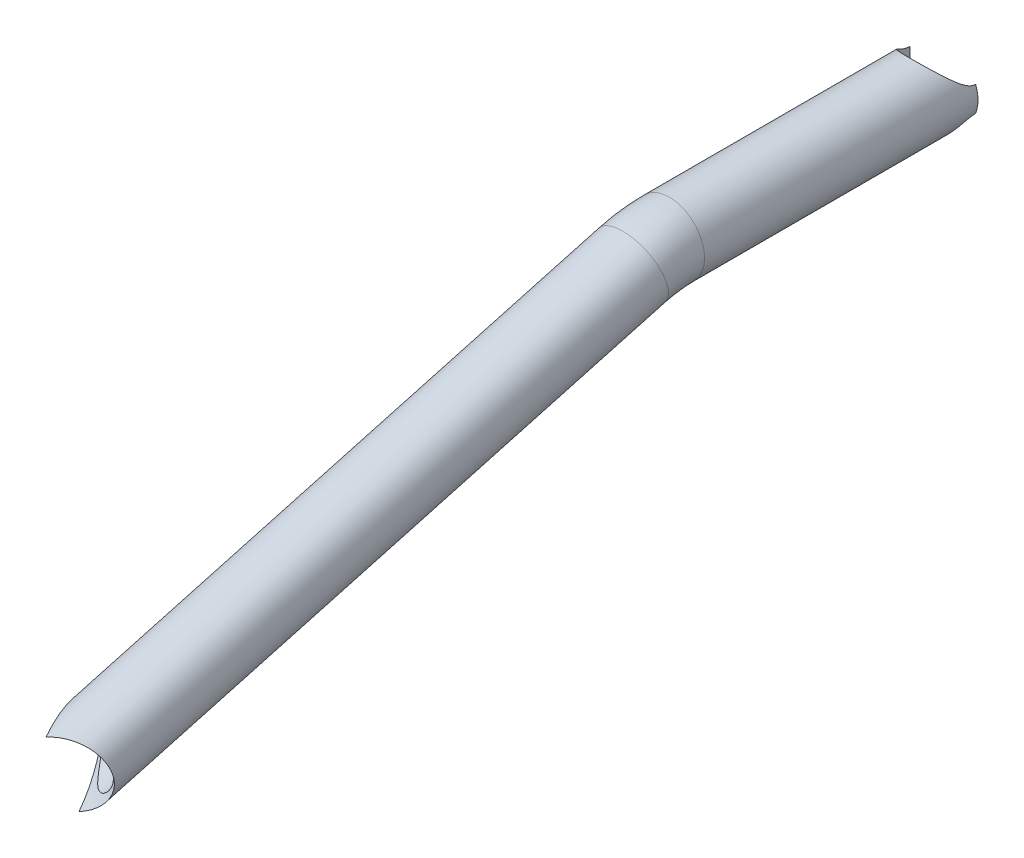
ISO-10303-21;
HEADER;
FILE_DESCRIPTION(('STEP AP214'),'2;1');
FILE_NAME('part.step','',(''),(''),'','','');
FILE_SCHEMA(('AUTOMOTIVE_DESIGN { 1 0 10303 214 1 1 1 1 }'));
ENDSEC;
DATA;
#1=APPLICATION_CONTEXT('core data for automotive mechanical design processes');
#2=APPLICATION_PROTOCOL_DEFINITION('international standard','automotive_design',2000,#1);
#3=PRODUCT_CONTEXT('',#1,'mechanical');
#4=PRODUCT('Part','Part','',(#3));
#5=PRODUCT_RELATED_PRODUCT_CATEGORY('part','',(#4));
#6=PRODUCT_DEFINITION_FORMATION('','',#4);
#7=PRODUCT_DEFINITION_CONTEXT('part definition',#1,'design');
#8=PRODUCT_DEFINITION('design','',#6,#7);
#9=PRODUCT_DEFINITION_SHAPE('','',#8);
#10=(LENGTH_UNIT() NAMED_UNIT(*) SI_UNIT(.MILLI.,.METRE.));
#11=(NAMED_UNIT(*) PLANE_ANGLE_UNIT() SI_UNIT($,.RADIAN.));
#12=(NAMED_UNIT(*) SI_UNIT($,.STERADIAN.) SOLID_ANGLE_UNIT());
#13=UNCERTAINTY_MEASURE_WITH_UNIT(LENGTH_MEASURE(1.E-05),#10,'distance_accuracy_value','');
#14=(GEOMETRIC_REPRESENTATION_CONTEXT(3) GLOBAL_UNCERTAINTY_ASSIGNED_CONTEXT((#13)) GLOBAL_UNIT_ASSIGNED_CONTEXT((#10,
#11,#12)) REPRESENTATION_CONTEXT('',''));
#15=CARTESIAN_POINT('',(0.,0.,0.));
#16=DIRECTION('',(0.,0.,1.));
#17=DIRECTION('',(1.,0.,0.));
#18=AXIS2_PLACEMENT_3D('',#15,#16,#17);
#19=CARTESIAN_POINT('',(109.471848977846,163.773719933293,0.));
#20=DIRECTION('',(0.,0.,1.));
#21=DIRECTION('',(1.,0.,0.));
#22=AXIS2_PLACEMENT_3D('',#19,#20,#21);
#23=PLANE('',#22);
#24=CARTESIAN_POINT('',(109.471848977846,163.773719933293,0.));
#25=DIRECTION('',(0.,0.,1.));
#26=DIRECTION('',(1.,0.,0.));
#27=AXIS2_PLACEMENT_3D('',#24,#25,#26);
#28=CIRCLE('',#27,15.);
#29=CARTESIAN_POINT('',(123.471848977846,158.388555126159,0.));
#30=VERTEX_POINT('',#29);
#31=CARTESIAN_POINT('',(123.471848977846,169.158884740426,0.));
#32=VERTEX_POINT('',#31);
#33=EDGE_CURVE('E105',#30,#32,#28,.T.);
#34=ORIENTED_EDGE('',*,*,#33,.F.);
#35=DIRECTION('',(0.,1.,0.));
#36=VECTOR('',#35,1.);
#37=CARTESIAN_POINT('',(123.471848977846,80.534273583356,0.));
#38=LINE('',#37,#36);
#39=EDGE_CURVE('E11',#30,#32,#38,.T.);
#40=ORIENTED_EDGE('',*,*,#39,.T.);
#41=EDGE_LOOP('',(#34,#40));
#42=FACE_BOUND('',#41,.T.);
#43=ADVANCED_FACE('F33',(#42),#23,.F.);
#44=CARTESIAN_POINT('',(109.471848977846,161.636625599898,132.498686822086));
#45=DIRECTION('',(0.,-0.264514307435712,0.964381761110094));
#46=DIRECTION('',(0.,-0.964381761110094,-0.264514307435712));
#47=AXIS2_PLACEMENT_3D('',#44,#45,#46);
#48=CYLINDRICAL_SURFACE('',#47,15.);
#49=CARTESIAN_POINT('',(109.471848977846,95.0000000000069,375.446400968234));
#50=DIRECTION('',(0.433930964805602,-0.147582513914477,0.888776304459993));
#51=DIRECTION('',(-0.876354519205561,-0.298053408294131,0.378374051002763));
#52=AXIS2_PLACEMENT_3D('',#49,#50,#51);
#53=ELLIPSE('',#52,16.7381320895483,15.);
#54=CARTESIAN_POINT('',(112.607770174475,80.8539297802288,371.56636287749));
#55=VERTEX_POINT('',#54);
#56=CARTESIAN_POINT('',(106.335927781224,109.146070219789,379.32643905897));
#57=VERTEX_POINT('',#56);
#58=EDGE_CURVE('E47',#55,#57,#53,.T.);
#59=ORIENTED_EDGE('',*,*,#58,.F.);
#60=CARTESIAN_POINT('',(109.471848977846,95.0000000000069,375.446400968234));
#61=DIRECTION('',(-0.876354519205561,-0.298053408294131,0.378374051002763));
#62=DIRECTION('',(0.433930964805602,-0.147582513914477,0.888776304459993));
#63=AXIS2_PLACEMENT_3D('',#60,#61,#62);
#64=ELLIPSE('',#63,33.8038510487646,15.);
#65=EDGE_CURVE('E66',#57,#55,#64,.T.);
#66=ORIENTED_EDGE('',*,*,#65,.F.);
#67=EDGE_LOOP('',(#59,#66));
#68=FACE_BOUND('',#67,.T.);
#69=CARTESIAN_POINT('',(109.471848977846,161.636625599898,132.498686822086));
#70=DIRECTION('',(0.,-0.264514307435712,0.964381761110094));
#71=DIRECTION('',(1.,0.,0.));
#72=AXIS2_PLACEMENT_3D('',#69,#70,#71);
#73=CIRCLE('',#72,15.);
#74=CARTESIAN_POINT('',(109.471848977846,176.10235201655,136.466401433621));
#75=VERTEX_POINT('',#74);
#76=EDGE_CURVE('E156',#75,#75,#73,.T.);
#77=ORIENTED_EDGE('',*,*,#76,.T.);
#78=EDGE_LOOP('',(#77));
#79=FACE_BOUND('',#78,.T.);
#80=ADVANCED_FACE('F35',(#68,#79),#48,.T.);
#81=CARTESIAN_POINT('',(109.471848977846,161.636625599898,132.498686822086));
#82=DIRECTION('',(0.,-0.264514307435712,0.964381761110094));
#83=DIRECTION('',(0.,-0.964381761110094,-0.264514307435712));
#84=AXIS2_PLACEMENT_3D('',#81,#82,#83);
#85=CYLINDRICAL_SURFACE('',#84,13.);
#86=CARTESIAN_POINT('',(109.471848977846,85.6589249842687,360.355959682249));
#87=CARTESIAN_POINT('',(109.673099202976,85.596906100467,360.582080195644));
#88=CARTESIAN_POINT('',(109.877765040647,85.5401497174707,360.806613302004));
#89=CARTESIAN_POINT('',(110.295252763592,85.438777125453,361.250902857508));
#90=CARTESIAN_POINT('',(110.508075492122,85.3941621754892,361.47065880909));
#91=CARTESIAN_POINT('',(110.943080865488,85.319268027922,361.903061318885));
#92=CARTESIAN_POINT('',(111.165257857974,85.2889803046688,362.115712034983));
#93=CARTESIAN_POINT('',(111.620317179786,85.2455409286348,362.531121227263));
#94=CARTESIAN_POINT('',(111.853195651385,85.2323831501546,362.733883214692));
#95=CARTESIAN_POINT('',(112.267022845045,85.2274459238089,363.073799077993));
#96=CARTESIAN_POINT('',(112.445341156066,85.2309176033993,363.214077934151));
#97=CARTESIAN_POINT('',(112.808023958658,85.2505216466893,363.485607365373));
#98=CARTESIAN_POINT('',(112.992386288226,85.266649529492,363.616861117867));
#99=CARTESIAN_POINT('',(113.366199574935,85.3130120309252,363.86835480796));
#100=CARTESIAN_POINT('',(113.555637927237,85.3432142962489,363.988619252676));
#101=CARTESIAN_POINT('',(113.938806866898,85.4189670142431,364.21690468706));
#102=CARTESIAN_POINT('',(114.132537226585,85.4645166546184,364.324926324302));
#103=CARTESIAN_POINT('',(114.523864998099,85.5721141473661,364.528345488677));
#104=CARTESIAN_POINT('',(114.721479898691,85.634274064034,364.623650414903));
#105=CARTESIAN_POINT('',(115.117028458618,85.7750868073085,364.800389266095));
#106=CARTESIAN_POINT('',(115.314962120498,85.8537397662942,364.881823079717));
#107=CARTESIAN_POINT('',(115.709208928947,86.0271968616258,365.031452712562));
#108=CARTESIAN_POINT('',(115.905518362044,86.1220308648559,365.099623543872));
#109=CARTESIAN_POINT('',(116.294080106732,86.3267642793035,365.22377056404));
#110=CARTESIAN_POINT('',(116.486331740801,86.4366661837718,365.279744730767));
#111=CARTESIAN_POINT('',(116.908650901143,86.6971713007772,365.392841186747));
#112=CARTESIAN_POINT('',(117.137249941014,86.8513227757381,365.447268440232));
#113=CARTESIAN_POINT('',(117.583529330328,87.1781548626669,365.543687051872));
#114=CARTESIAN_POINT('',(117.8012067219,87.3508404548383,365.585675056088));
#115=CARTESIAN_POINT('',(118.224574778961,87.7128542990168,365.660621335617));
#116=CARTESIAN_POINT('',(118.43024189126,87.9022135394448,365.693562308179));
#117=CARTESIAN_POINT('',(118.828191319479,88.295359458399,365.753249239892));
#118=CARTESIAN_POINT('',(119.02047313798,88.4991466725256,365.779994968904));
#119=CARTESIAN_POINT('',(119.447594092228,88.9837163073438,365.837385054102));
#120=CARTESIAN_POINT('',(119.677504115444,89.2690109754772,365.866726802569));
#121=CARTESIAN_POINT('',(120.11229477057,89.8582869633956,365.923491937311));
#122=CARTESIAN_POINT('',(120.317169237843,90.1622728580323,365.950914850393));
#123=CARTESIAN_POINT('',(120.700820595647,90.7860860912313,366.007155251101));
#124=CARTESIAN_POINT('',(120.879602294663,91.1059104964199,366.035972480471));
#125=CARTESIAN_POINT('',(121.210121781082,91.7588438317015,366.097530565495));
#126=CARTESIAN_POINT('',(121.361861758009,92.0919516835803,366.130271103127));
#127=CARTESIAN_POINT('',(121.638178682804,92.7709643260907,366.201794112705));
#128=CARTESIAN_POINT('',(121.762588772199,93.1169334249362,366.24061134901));
#129=CARTESIAN_POINT('',(121.982161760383,93.8171718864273,366.32557718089));
#130=CARTESIAN_POINT('',(122.077324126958,94.1714413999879,366.371725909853));
#131=CARTESIAN_POINT('',(122.237543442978,94.8854760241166,366.472345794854));
#132=CARTESIAN_POINT('',(122.302608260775,95.2452396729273,366.526814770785));
#133=CARTESIAN_POINT('',(122.401991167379,95.9675401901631,366.644713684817));
#134=CARTESIAN_POINT('',(122.436309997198,96.33007699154,366.708143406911));
#135=CARTESIAN_POINT('',(122.473474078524,97.0497994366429,366.84327041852));
#136=CARTESIAN_POINT('',(122.476766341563,97.4069868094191,366.914835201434));
#137=CARTESIAN_POINT('',(122.45285654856,98.1184292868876,367.066923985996));
#138=CARTESIAN_POINT('',(122.425654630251,98.4726844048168,367.147447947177));
#139=CARTESIAN_POINT('',(122.340863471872,99.1754009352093,367.317134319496));
#140=CARTESIAN_POINT('',(122.283277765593,99.5238630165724,367.406295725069));
#141=CARTESIAN_POINT('',(122.138127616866,100.212276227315,367.592685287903));
#142=CARTESIAN_POINT('',(122.050564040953,100.552227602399,367.689913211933));
#143=CARTESIAN_POINT('',(121.850349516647,101.207326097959,367.887481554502));
#144=CARTESIAN_POINT('',(121.73886942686,101.522919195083,367.987532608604));
#145=CARTESIAN_POINT('',(121.489859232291,102.141706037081,368.19335366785));
#146=CARTESIAN_POINT('',(121.352329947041,102.444900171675,368.299123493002));
#147=CARTESIAN_POINT('',(121.052319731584,103.036896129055,368.515246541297));
#148=CARTESIAN_POINT('',(120.889842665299,103.325700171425,368.625599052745));
#149=CARTESIAN_POINT('',(120.541161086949,103.887252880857,368.849606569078));
#150=CARTESIAN_POINT('',(120.354956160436,104.160001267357,368.96326163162));
#151=CARTESIAN_POINT('',(119.958245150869,104.690560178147,369.193520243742));
#152=CARTESIAN_POINT('',(119.747518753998,104.948198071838,369.310141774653));
#153=CARTESIAN_POINT('',(119.304734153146,105.444359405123,369.543526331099));
#154=CARTESIAN_POINT('',(119.072675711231,105.68288263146,369.660289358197));
#155=CARTESIAN_POINT('',(118.588510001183,106.140042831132,369.892106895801));
#156=CARTESIAN_POINT('',(118.336384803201,106.358661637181,370.007159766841));
#157=CARTESIAN_POINT('',(117.813765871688,106.775044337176,370.233189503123));
#158=CARTESIAN_POINT('',(117.543272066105,106.972808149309,370.344166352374));
#159=CARTESIAN_POINT('',(116.971421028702,107.356356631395,370.564777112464));
#160=CARTESIAN_POINT('',(116.669196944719,107.541048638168,370.674066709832));
#161=CARTESIAN_POINT('',(116.047698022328,107.886653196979,370.881536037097));
#162=CARTESIAN_POINT('',(115.728419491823,108.047560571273,370.979713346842));
#163=CARTESIAN_POINT('',(115.074901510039,108.345391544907,371.160200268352));
#164=CARTESIAN_POINT('',(114.740676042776,108.482336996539,371.242524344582));
#165=CARTESIAN_POINT('',(114.059069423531,108.732634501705,371.385517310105));
#166=CARTESIAN_POINT('',(113.711695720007,108.845999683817,371.446198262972));
#167=CARTESIAN_POINT('',(113.134190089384,109.012914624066,371.52182166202));
#168=CARTESIAN_POINT('',(112.907122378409,109.07326430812,371.545369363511));
#169=CARTESIAN_POINT('',(112.449784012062,109.184901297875,371.57840963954));
#170=CARTESIAN_POINT('',(112.219514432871,109.236191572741,371.587906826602));
#171=CARTESIAN_POINT('',(111.757594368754,109.329981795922,371.590510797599));
#172=CARTESIAN_POINT('',(111.52594811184,109.372501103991,371.583654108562));
#173=CARTESIAN_POINT('',(111.062548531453,109.44938411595,371.55138111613));
#174=CARTESIAN_POINT('',(110.830795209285,109.483747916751,371.525965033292));
#175=CARTESIAN_POINT('',(110.366852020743,109.545294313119,371.454369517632));
#176=CARTESIAN_POINT('',(110.134685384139,109.572393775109,371.40796480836));
#177=CARTESIAN_POINT('',(109.675084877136,109.619715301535,371.293347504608));
#178=CARTESIAN_POINT('',(109.4476505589,109.63993801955,371.225136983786));
#179=CARTESIAN_POINT('',(108.999964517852,109.674422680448,371.067117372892));
#180=CARTESIAN_POINT('',(108.779712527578,109.688684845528,370.977309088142));
#181=CARTESIAN_POINT('',(108.348300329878,109.712176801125,370.777497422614));
#182=CARTESIAN_POINT('',(108.137141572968,109.721405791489,370.667490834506));
#183=CARTESIAN_POINT('',(107.691070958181,109.736849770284,370.409906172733));
#184=CARTESIAN_POINT('',(107.457988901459,109.742316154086,370.259123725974));
#185=CARTESIAN_POINT('',(107.006168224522,109.748619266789,369.937404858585));
#186=CARTESIAN_POINT('',(106.787433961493,109.749454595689,369.766462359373));
#187=CARTESIAN_POINT('',(106.362902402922,109.74721563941,369.407840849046));
#188=CARTESIAN_POINT('',(106.157155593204,109.744126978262,369.220102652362));
#189=CARTESIAN_POINT('',(105.758247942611,109.734460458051,368.83191542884));
#190=CARTESIAN_POINT('',(105.565086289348,109.727882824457,368.631467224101));
#191=CARTESIAN_POINT('',(105.134996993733,109.709071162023,368.160513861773));
#192=CARTESIAN_POINT('',(104.90179210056,109.695745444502,367.886665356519));
#193=CARTESIAN_POINT('',(104.450928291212,109.663796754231,367.326670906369));
#194=CARTESIAN_POINT('',(104.233276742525,109.645171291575,367.04051923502));
#195=CARTESIAN_POINT('',(103.810769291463,109.602487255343,366.458609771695));
#196=CARTESIAN_POINT('',(103.605936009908,109.57841940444,366.162836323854));
#197=CARTESIAN_POINT('',(103.207517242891,109.524637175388,365.564415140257));
#198=CARTESIAN_POINT('',(103.013929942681,109.494923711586,365.261768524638));
#199=CARTESIAN_POINT('',(102.635488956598,109.429363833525,364.649632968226));
#200=CARTESIAN_POINT('',(102.450683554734,109.393487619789,364.340117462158));
#201=CARTESIAN_POINT('',(102.089657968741,109.315318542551,363.716916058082));
#202=CARTESIAN_POINT('',(101.913438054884,109.273025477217,363.403230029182));
#203=CARTESIAN_POINT('',(101.568888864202,109.18163245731,362.772951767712));
#204=CARTESIAN_POINT('',(101.400551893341,109.132539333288,362.456362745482));
#205=CARTESIAN_POINT('',(101.070960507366,109.027029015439,361.820733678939));
#206=CARTESIAN_POINT('',(100.90970603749,108.970611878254,361.5016936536));
#207=CARTESIAN_POINT('',(100.584027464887,108.846155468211,360.841892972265));
#208=CARTESIAN_POINT('',(100.42003072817,108.777611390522,360.501016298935));
#209=CARTESIAN_POINT('',(100.09926138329,108.63091739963,359.81792302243));
#210=CARTESIAN_POINT('',(99.9424888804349,108.552767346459,359.475706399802));
#211=CARTESIAN_POINT('',(99.6359682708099,108.385970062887,358.79036443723));
#212=CARTESIAN_POINT('',(99.4862253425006,108.297315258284,358.447238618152));
#213=CARTESIAN_POINT('',(99.1939845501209,108.108598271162,357.761034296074));
#214=CARTESIAN_POINT('',(99.0514865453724,108.008536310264,357.417955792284));
#215=CARTESIAN_POINT('',(98.7744652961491,107.796234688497,356.733716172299));
#216=CARTESIAN_POINT('',(98.6399179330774,107.684035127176,356.392552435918));
#217=CARTESIAN_POINT('',(98.3787860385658,107.445903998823,355.711916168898));
#218=CARTESIAN_POINT('',(98.2522021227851,107.319971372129,355.372443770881));
#219=CARTESIAN_POINT('',(98.0078704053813,107.053015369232,354.696695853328));
#220=CARTESIAN_POINT('',(97.8901132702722,106.912008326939,354.360417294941));
#221=CARTESIAN_POINT('',(97.6643349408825,106.613059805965,353.692207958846));
#222=CARTESIAN_POINT('',(97.5563113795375,106.455122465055,353.360276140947));
#223=CARTESIAN_POINT('',(97.345655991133,106.110900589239,352.68429908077));
#224=CARTESIAN_POINT('',(97.2436568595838,105.923528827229,352.340604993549));
#225=CARTESIAN_POINT('',(97.0541798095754,105.524663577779,351.663052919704));
#226=CARTESIAN_POINT('',(96.9667068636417,105.313161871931,351.32919833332));
#227=CARTESIAN_POINT('',(96.8096802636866,104.863967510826,350.677429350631));
#228=CARTESIAN_POINT('',(96.7400411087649,104.626407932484,350.359445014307));
#229=CARTESIAN_POINT('',(96.6220536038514,104.121384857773,349.744300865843));
#230=CARTESIAN_POINT('',(96.5736787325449,103.853959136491,349.447115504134));
#231=CARTESIAN_POINT('',(96.5035909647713,103.291367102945,348.886936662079));
#232=CARTESIAN_POINT('',(96.4814048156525,102.996800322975,348.623415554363));
#233=CARTESIAN_POINT('',(96.4707689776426,102.531349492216,348.257682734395));
#234=CARTESIAN_POINT('',(96.4710002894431,102.372225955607,348.140672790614));
#235=CARTESIAN_POINT('',(96.47960544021,102.046442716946,347.918052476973));
#236=CARTESIAN_POINT('',(96.4879756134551,101.879786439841,347.812436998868));
#237=CARTESIAN_POINT('',(96.5134889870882,101.537795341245,347.613136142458));
#238=CARTESIAN_POINT('',(96.5307213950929,101.362388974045,347.51958441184));
#239=CARTESIAN_POINT('',(96.5743462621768,101.005548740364,347.347225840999));
#240=CARTESIAN_POINT('',(96.6007384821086,100.824115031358,347.268418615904));
#241=CARTESIAN_POINT('',(96.6627522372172,100.45675687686,347.126860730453));
#242=CARTESIAN_POINT('',(96.6983672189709,100.270835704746,347.064098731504));
#243=CARTESIAN_POINT('',(96.7786372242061,99.8960564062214,346.955395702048));
#244=CARTESIAN_POINT('',(96.8232915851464,99.7071984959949,346.90945343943));
#245=CARTESIAN_POINT('',(96.9160769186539,99.3479839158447,346.838560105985));
#246=CARTESIAN_POINT('',(96.9633679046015,99.1777383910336,346.811926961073));
#247=CARTESIAN_POINT('',(97.0643312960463,98.8375052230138,346.772238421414));
#248=CARTESIAN_POINT('',(97.1180057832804,98.6675176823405,346.759187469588));
#249=CARTESIAN_POINT('',(97.2311340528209,98.3289340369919,346.746211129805));
#250=CARTESIAN_POINT('',(97.2905895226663,98.1603383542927,346.746289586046));
#251=CARTESIAN_POINT('',(97.4146231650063,97.8254971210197,346.758868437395));
#252=CARTESIAN_POINT('',(97.4792026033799,97.6592521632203,346.771371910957));
#253=CARTESIAN_POINT('',(97.6381492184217,97.2674581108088,346.814877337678));
#254=CARTESIAN_POINT('',(97.734533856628,97.0432978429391,346.851092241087));
#255=CARTESIAN_POINT('',(97.9342193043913,96.6021697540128,346.943038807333));
#256=CARTESIAN_POINT('',(98.0375230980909,96.385205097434,346.99877893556));
#257=CARTESIAN_POINT('',(98.2498469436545,95.9588363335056,347.127409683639));
#258=CARTESIAN_POINT('',(98.358876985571,95.7494465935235,347.200331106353));
#259=CARTESIAN_POINT('',(98.5813275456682,95.3389527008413,347.360959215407));
#260=CARTESIAN_POINT('',(98.6947474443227,95.1378473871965,347.448663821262));
#261=CARTESIAN_POINT('',(99.0005862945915,94.6147182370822,347.698495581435));
#262=CARTESIAN_POINT('',(99.196084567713,94.2997823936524,347.871739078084));
#263=CARTESIAN_POINT('',(99.5938200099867,93.6911844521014,348.245711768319));
#264=CARTESIAN_POINT('',(99.7960618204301,93.3975374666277,348.446460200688));
#265=CARTESIAN_POINT('',(100.205772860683,92.829463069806,348.870181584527));
#266=CARTESIAN_POINT('',(100.413252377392,92.5550782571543,349.093201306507));
#267=CARTESIAN_POINT('',(100.831893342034,92.0245126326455,349.556874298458));
#268=CARTESIAN_POINT('',(101.043056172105,91.7683388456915,349.797534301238));
#269=CARTESIAN_POINT('',(101.463537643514,91.2783298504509,350.287620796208));
#270=CARTESIAN_POINT('',(101.672793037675,91.0441248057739,350.536733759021));
#271=CARTESIAN_POINT('',(102.093648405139,90.5906471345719,351.046177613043));
#272=CARTESIAN_POINT('',(102.305248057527,90.3713724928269,351.306506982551));
#273=CARTESIAN_POINT('',(102.730867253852,89.9465173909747,351.836765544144));
#274=CARTESIAN_POINT('',(102.944889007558,89.7409508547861,352.106704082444));
#275=CARTESIAN_POINT('',(103.375156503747,89.3429488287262,352.654366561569));
#276=CARTESIAN_POINT('',(103.591402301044,89.1505136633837,352.932090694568));
#277=CARTESIAN_POINT('',(104.026327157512,88.7781207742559,353.494058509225));
#278=CARTESIAN_POINT('',(104.245006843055,88.5981663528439,353.778303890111));
#279=CARTESIAN_POINT('',(104.68504690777,88.2503646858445,354.352071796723));
#280=CARTESIAN_POINT('',(104.9064073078,88.0825175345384,354.64159436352));
#281=CARTESIAN_POINT('',(105.352130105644,87.7587949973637,355.224660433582));
#282=CARTESIAN_POINT('',(105.576490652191,87.602912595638,355.518201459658));
#283=CARTESIAN_POINT('',(106.028956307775,87.3029976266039,356.108401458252));
#284=CARTESIAN_POINT('',(106.257061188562,87.1589643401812,356.405060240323));
#285=CARTESIAN_POINT('',(106.722938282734,86.8799245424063,357.006973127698));
#286=CARTESIAN_POINT('',(106.960812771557,86.7451864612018,357.312272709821));
#287=CARTESIAN_POINT('',(107.442542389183,86.488886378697,357.923707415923));
#288=CARTESIAN_POINT('',(107.686397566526,86.3673244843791,358.229842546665));
#289=CARTESIAN_POINT('',(108.181453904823,86.1384933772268,358.841160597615));
#290=CARTESIAN_POINT('',(108.432649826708,86.0312142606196,359.146344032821));
#291=CARTESIAN_POINT('',(108.944515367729,85.832519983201,359.75393365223));
#292=CARTESIAN_POINT('',(109.205183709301,85.7411026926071,360.056340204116));
#293=CARTESIAN_POINT('',(109.471848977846,85.6589249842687,360.355959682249));
#294=B_SPLINE_CURVE_WITH_KNOTS('',3,(#86,#87,#88,#89,#90,#91,#92,#93,#94,#95,#96,#97,#98,#99,
#100,#101,#102,#103,#104,#105,#106,#107,#108,#109,#110,#111,#112,#113,#114,#115,#116,#117,#118,
#119,#120,#121,#122,#123,#124,#125,#126,#127,#128,#129,#130,#131,#132,#133,#134,#135,#136,#137,
#138,#139,#140,#141,#142,#143,#144,#145,#146,#147,#148,#149,#150,#151,#152,#153,#154,#155,#156,
#157,#158,#159,#160,#161,#162,#163,#164,#165,#166,#167,#168,#169,#170,#171,#172,#173,#174,#175,
#176,#177,#178,#179,#180,#181,#182,#183,#184,#185,#186,#187,#188,#189,#190,#191,#192,#193,#194,
#195,#196,#197,#198,#199,#200,#201,#202,#203,#204,#205,#206,#207,#208,#209,#210,#211,#212,#213,
#214,#215,#216,#217,#218,#219,#220,#221,#222,#223,#224,#225,#226,#227,#228,#229,#230,#231,#232,
#233,#234,#235,#236,#237,#238,#239,#240,#241,#242,#243,#244,#245,#246,#247,#248,#249,#250,#251,
#252,#253,#254,#255,#256,#257,#258,#259,#260,#261,#262,#263,#264,#265,#266,#267,#268,#269,#270,
#271,#272,#273,#274,#275,#276,#277,#278,#279,#280,#281,#282,#283,#284,#285,#286,#287,#288,#289,
#290,#291,#292,#293),.UNSPECIFIED.,.T.,.F.,(4,2,2,2,2,2,2,2,2,2,2,2,2,2,2,2,2,2,2,2,2,2,2,2,2,2,
2,2,2,2,2,2,2,2,2,2,2,2,2,2,2,2,2,2,2,2,2,2,2,2,2,2,2,2,2,2,2,2,2,2,2,2,2,2,2,2,2,2,2,2,2,2,2,2,
2,2,2,2,2,2,2,2,2,2,2,2,2,2,2,2,2,2,2,2,2,2,2,2,2,2,2,2,2,4),(0.,0.926904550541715,
1.85390518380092,2.78035349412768,3.70647041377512,4.3866762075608,5.06664128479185,
5.74505095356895,6.42342472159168,7.10649616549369,7.78957309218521,8.47392475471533,
9.15838979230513,10.0002280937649,10.8422931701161,11.6859576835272,12.5296535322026,
13.6309256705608,14.7324684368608,15.8338079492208,16.9350582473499,18.0428559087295,
19.1506737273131,20.2582017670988,21.3657031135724,22.4572234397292,23.5487388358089,
24.6401273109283,25.7314842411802,26.7782619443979,27.8250067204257,28.8715895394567,
29.9181906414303,30.9750507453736,32.0319226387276,33.0897496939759,34.1475808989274,
35.2582802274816,36.3692209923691,37.4791432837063,38.58844594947,39.2963091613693,
40.0039399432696,40.7099916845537,41.4160350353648,42.1298432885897,42.8435836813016,
43.5572974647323,44.2711246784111,45.1027375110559,45.934601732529,46.7695223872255,
47.6043890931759,48.6834315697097,49.7629818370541,50.8443864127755,51.9256159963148,
53.0122290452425,54.0988762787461,55.1844398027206,56.2699949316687,57.423113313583,
58.5762484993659,59.7302202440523,60.8841695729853,62.034416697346,63.1847526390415,
64.333854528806,65.4826762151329,66.6953047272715,67.9083474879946,69.1154607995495,
70.3210642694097,71.5045306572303,72.0965397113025,72.688282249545,73.2861013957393,
73.8839049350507,74.4812848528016,75.078621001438,75.6140479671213,76.1496500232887,
76.685408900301,77.2213005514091,77.9601786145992,78.6993774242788,79.4399117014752,
80.180341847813,81.4058078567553,82.6321354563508,83.8610948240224,85.0905257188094,
86.2926438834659,87.4945994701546,88.6977579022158,89.900946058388,91.1044513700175,
92.3079660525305,93.5107695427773,94.7134999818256,95.9427005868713,97.1719111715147,
98.4002649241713,99.6284536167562),.UNSPECIFIED.);
#295=CARTESIAN_POINT('',(109.471848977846,85.6589249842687,360.355959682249));
#296=VERTEX_POINT('',#295);
#297=EDGE_CURVE('E70',#296,#296,#294,.T.);
#298=ORIENTED_EDGE('',*,*,#297,.T.);
#299=EDGE_LOOP('',(#298));
#300=FACE_BOUND('',#299,.T.);
#301=CARTESIAN_POINT('',(109.471848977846,161.636625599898,132.498686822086));
#302=DIRECTION('',(0.,-0.264514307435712,0.964381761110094));
#303=DIRECTION('',(1.,0.,0.));
#304=AXIS2_PLACEMENT_3D('',#301,#302,#303);
#305=CIRCLE('',#304,13.);
#306=CARTESIAN_POINT('',(109.471848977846,174.173588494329,135.93737281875));
#307=VERTEX_POINT('',#306);
#308=EDGE_CURVE('E153',#307,#307,#305,.T.);
#309=ORIENTED_EDGE('',*,*,#308,.F.);
#310=EDGE_LOOP('',(#309));
#311=FACE_BOUND('',#310,.T.);
#312=ADVANCED_FACE('F119',(#300,#311),#85,.F.);
#313=CARTESIAN_POINT('',(109.471848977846,103.773719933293,116.627828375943));
#314=DIRECTION('',(1.,0.,0.));
#315=DIRECTION('',(0.,1.,0.));
#316=AXIS2_PLACEMENT_3D('',#313,#314,#315);
#317=TOROIDAL_SURFACE('',#316,60.,15.);
#318=CARTESIAN_POINT('',(109.471848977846,163.773719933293,116.627828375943));
#319=DIRECTION('',(0.,0.,1.));
#320=DIRECTION('',(1.,0.,0.));
#321=AXIS2_PLACEMENT_3D('',#318,#319,#320);
#322=CIRCLE('',#321,15.);
#323=CARTESIAN_POINT('',(109.471848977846,178.773719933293,116.627828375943));
#324=VERTEX_POINT('',#323);
#325=EDGE_CURVE('E150',#324,#324,#322,.T.);
#326=CARTESIAN_POINT('',(109.471848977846,103.773719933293,116.627828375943));
#327=DIRECTION('',(1.,0.,0.));
#328=DIRECTION('',(0.,1.,0.));
#329=AXIS2_PLACEMENT_3D('',#326,#327,#328);
#330=CIRCLE('',#329,75.);
#331=EDGE_CURVE('',#324,#75,#330,.T.);
#332=ORIENTED_EDGE('',*,*,#325,.T.);
#333=ORIENTED_EDGE('',*,*,#76,.F.);
#334=ORIENTED_EDGE('',*,*,#331,.T.);
#335=ORIENTED_EDGE('',*,*,#331,.F.);
#336=EDGE_LOOP('',(#332,#334,#333,#335));
#337=FACE_BOUND('',#336,.T.);
#338=ADVANCED_FACE('F116',(#337),#317,.T.);
#339=CARTESIAN_POINT('',(109.471848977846,103.773719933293,116.627828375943));
#340=DIRECTION('',(1.,0.,0.));
#341=DIRECTION('',(0.,1.,0.));
#342=AXIS2_PLACEMENT_3D('',#339,#340,#341);
#343=TOROIDAL_SURFACE('',#342,60.,13.);
#344=CARTESIAN_POINT('',(109.471848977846,163.773719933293,116.627828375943));
#345=DIRECTION('',(0.,0.,1.));
#346=DIRECTION('',(1.,0.,0.));
#347=AXIS2_PLACEMENT_3D('',#344,#345,#346);
#348=CIRCLE('',#347,13.);
#349=CARTESIAN_POINT('',(109.471848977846,176.773719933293,116.627828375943));
#350=VERTEX_POINT('',#349);
#351=EDGE_CURVE('E106',#350,#350,#348,.T.);
#352=CARTESIAN_POINT('',(109.471848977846,103.773719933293,116.627828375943));
#353=DIRECTION('',(1.,0.,0.));
#354=DIRECTION('',(0.,1.,0.));
#355=AXIS2_PLACEMENT_3D('',#352,#353,#354);
#356=CIRCLE('',#355,73.);
#357=EDGE_CURVE('',#350,#307,#356,.T.);
#358=ORIENTED_EDGE('',*,*,#351,.F.);
#359=ORIENTED_EDGE('',*,*,#308,.T.);
#360=ORIENTED_EDGE('',*,*,#357,.T.);
#361=ORIENTED_EDGE('',*,*,#357,.F.);
#362=EDGE_LOOP('',(#358,#360,#359,#361));
#363=FACE_BOUND('',#362,.T.);
#364=ADVANCED_FACE('F112',(#363),#343,.F.);
#365=CARTESIAN_POINT('',(109.471848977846,163.773719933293,116.627828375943));
#366=DIRECTION('',(0.,0.,-1.));
#367=DIRECTION('',(-1.,0.,0.));
#368=AXIS2_PLACEMENT_3D('',#365,#366,#367);
#369=CYLINDRICAL_SURFACE('',#368,13.);
#370=CARTESIAN_POINT('',(96.4718489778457,163.773719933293,5.19615242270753));
#371=CARTESIAN_POINT('',(96.4718510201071,163.597434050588,5.19616099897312));
#372=CARTESIAN_POINT('',(96.4754497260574,163.421099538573,5.20518907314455));
#373=CARTESIAN_POINT('',(96.4896996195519,163.070398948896,5.24062406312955));
#374=CARTESIAN_POINT('',(96.5003564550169,162.896034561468,5.26704489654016));
#375=CARTESIAN_POINT('',(96.5283795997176,162.550274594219,5.33553731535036));
#376=CARTESIAN_POINT('',(96.5457728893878,162.378893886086,5.37767181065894));
#377=CARTESIAN_POINT('',(96.5867590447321,162.040653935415,5.47514849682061));
#378=CARTESIAN_POINT('',(96.6103557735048,161.873797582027,5.53049891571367));
#379=CARTESIAN_POINT('',(96.6773349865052,161.457341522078,5.68424561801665));
#380=CARTESIAN_POINT('',(96.7245599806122,161.211036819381,5.78986171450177));
#381=CARTESIAN_POINT('',(96.830927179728,160.729375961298,6.01855700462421));
#382=CARTESIAN_POINT('',(96.8900789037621,160.494028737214,6.14165012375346));
#383=CARTESIAN_POINT('',(97.0195230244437,160.032439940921,6.40004180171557));
#384=CARTESIAN_POINT('',(97.0898475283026,159.806227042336,6.53537503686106));
#385=CARTESIAN_POINT('',(97.2409655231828,159.362316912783,6.81400310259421));
#386=CARTESIAN_POINT('',(97.3217625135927,159.144622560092,6.95730058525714));
#387=CARTESIAN_POINT('',(97.4892117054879,158.727499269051,7.24170344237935));
#388=CARTESIAN_POINT('',(97.5753695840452,158.527701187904,7.38256055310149));
#389=CARTESIAN_POINT('',(97.7567325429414,158.134310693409,7.66710862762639));
#390=CARTESIAN_POINT('',(97.8519389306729,157.940719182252,7.81079999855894));
#391=CARTESIAN_POINT('',(98.1511968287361,157.368369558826,8.24414445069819));
#392=CARTESIAN_POINT('',(98.3688155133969,156.998213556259,8.53594381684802));
#393=CARTESIAN_POINT('',(98.8402434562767,156.28018749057,9.11640638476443));
#394=CARTESIAN_POINT('',(99.0940056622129,155.932289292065,9.40507314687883));
#395=CARTESIAN_POINT('',(99.6387899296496,155.259129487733,9.97325045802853));
#396=CARTESIAN_POINT('',(99.9297907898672,154.933855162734,10.2527661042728));
#397=CARTESIAN_POINT('',(100.469583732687,154.389393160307,10.7262585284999));
#398=CARTESIAN_POINT('',(100.709750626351,154.164569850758,10.9236196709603));
#399=CARTESIAN_POINT('',(101.211413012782,153.730050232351,11.3077393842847));
#400=CARTESIAN_POINT('',(101.472908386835,153.520353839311,11.4944980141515));
#401=CARTESIAN_POINT('',(102.016923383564,153.118283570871,11.8545495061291));
#402=CARTESIAN_POINT('',(102.299413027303,152.925885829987,12.0278608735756));
#403=CARTESIAN_POINT('',(102.885465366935,152.560391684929,12.3585058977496));
#404=CARTESIAN_POINT('',(103.189023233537,152.387290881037,12.5158431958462));
#405=CARTESIAN_POINT('',(103.752072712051,152.096264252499,12.7812433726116));
#406=CARTESIAN_POINT('',(104.007839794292,151.974302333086,12.892795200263));
#407=CARTESIAN_POINT('',(104.531446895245,151.745669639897,13.1023625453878));
#408=CARTESIAN_POINT('',(104.799284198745,151.638995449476,13.2003810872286));
#409=CARTESIAN_POINT('',(105.345922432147,151.442415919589,13.3813146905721));
#410=CARTESIAN_POINT('',(105.624719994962,151.35250547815,13.4642343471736));
#411=CARTESIAN_POINT('',(106.191890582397,151.190842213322,13.6135171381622));
#412=CARTESIAN_POINT('',(106.480263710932,151.119089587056,13.6798800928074));
#413=CARTESIAN_POINT('',(107.066761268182,150.99459465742,13.7951253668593));
#414=CARTESIAN_POINT('',(107.364940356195,150.941990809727,13.8438803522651));
#415=CARTESIAN_POINT('',(107.966740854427,150.8575688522,13.9221660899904));
#416=CARTESIAN_POINT('',(108.270362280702,150.825750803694,13.9516967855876));
#417=CARTESIAN_POINT('',(108.880255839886,150.783592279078,13.9908311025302));
#418=CARTESIAN_POINT('',(109.18652687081,150.773243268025,14.0004426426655));
#419=CARTESIAN_POINT('',(109.798987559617,150.774230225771,13.999526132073));
#420=CARTESIAN_POINT('',(110.105177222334,150.785564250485,13.9889998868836));
#421=CARTESIAN_POINT('',(110.68036810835,150.827173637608,13.9503767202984));
#422=CARTESIAN_POINT('',(110.949681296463,150.855177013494,13.9243875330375));
#423=CARTESIAN_POINT('',(111.484151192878,150.927578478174,13.8572423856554));
#424=CARTESIAN_POINT('',(111.749308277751,150.971975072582,13.8160878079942));
#425=CARTESIAN_POINT('',(112.273828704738,151.076458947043,13.7193311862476));
#426=CARTESIAN_POINT('',(112.533191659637,151.136547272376,13.6637281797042));
#427=CARTESIAN_POINT('',(113.044699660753,151.271531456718,13.5389826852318));
#428=CARTESIAN_POINT('',(113.296844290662,151.34642816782,13.4698394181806));
#429=CARTESIAN_POINT('',(113.801947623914,151.513068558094,13.3162490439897));
#430=CARTESIAN_POINT('',(114.054589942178,151.605333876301,13.2313295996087));
#431=CARTESIAN_POINT('',(114.549963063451,151.803591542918,13.0492312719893));
#432=CARTESIAN_POINT('',(114.792690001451,151.909589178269,12.9520476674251));
#433=CARTESIAN_POINT('',(115.26744174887,152.134129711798,12.746685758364));
#434=CARTESIAN_POINT('',(115.49946619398,152.252673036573,12.6385070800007));
#435=CARTESIAN_POINT('',(115.952373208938,152.501206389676,12.4123691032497));
#436=CARTESIAN_POINT('',(116.173253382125,152.631198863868,12.2944077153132));
#437=CARTESIAN_POINT('',(116.716326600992,152.972447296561,11.9858136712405));
#438=CARTESIAN_POINT('',(117.030985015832,153.190603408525,11.7894805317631));
#439=CARTESIAN_POINT('',(117.633466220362,153.647951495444,11.3807140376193));
#440=CARTESIAN_POINT('',(117.921276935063,153.88715284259,11.1682735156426));
#441=CARTESIAN_POINT('',(118.470887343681,154.384628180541,10.7303799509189));
#442=CARTESIAN_POINT('',(118.732619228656,154.642948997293,10.5048952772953));
#443=CARTESIAN_POINT('',(119.229675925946,155.1761812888,10.0448726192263));
#444=CARTESIAN_POINT('',(119.465005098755,155.451090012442,9.81033613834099));
#445=CARTESIAN_POINT('',(119.915472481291,156.023449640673,9.3296247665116));
#446=CARTESIAN_POINT('',(120.129956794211,156.321292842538,9.08330550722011));
#447=CARTESIAN_POINT('',(120.532472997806,156.932907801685,8.58861253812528));
#448=CARTESIAN_POINT('',(120.720496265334,157.246684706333,8.34023818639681));
#449=CARTESIAN_POINT('',(121.069940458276,157.890012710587,7.84699531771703));
#450=CARTESIAN_POINT('',(121.231421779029,158.219525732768,7.60212003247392));
#451=CARTESIAN_POINT('',(121.52806824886,158.896804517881,7.12228312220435));
#452=CARTESIAN_POINT('',(121.663253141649,159.244556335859,6.88731416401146));
#453=CARTESIAN_POINT('',(121.890216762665,159.914696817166,6.46784684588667));
#454=CARTESIAN_POINT('',(121.985379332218,160.234288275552,6.28079570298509));
#455=CARTESIAN_POINT('',(122.111389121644,160.728911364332,6.02091456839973));
#456=CARTESIAN_POINT('',(122.150606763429,160.896344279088,5.93772878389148));
#457=CARTESIAN_POINT('',(122.223067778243,161.236643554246,5.78047461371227));
#458=CARTESIAN_POINT('',(122.256311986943,161.409509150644,5.70640495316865));
#459=CARTESIAN_POINT('',(122.335816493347,161.875165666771,5.52570764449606));
#460=CARTESIAN_POINT('',(122.376557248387,162.17309996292,5.42907315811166));
#461=CARTESIAN_POINT('',(122.422288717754,162.629398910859,5.3186190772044));
#462=CARTESIAN_POINT('',(122.434964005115,162.782899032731,5.28756520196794));
#463=CARTESIAN_POINT('',(122.454900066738,163.09227771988,5.23842472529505));
#464=CARTESIAN_POINT('',(122.46216389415,163.24815489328,5.2203308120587));
#465=CARTESIAN_POINT('',(122.471092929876,163.562513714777,5.19805821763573));
#466=CARTESIAN_POINT('',(122.472706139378,163.721006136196,5.19400878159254));
#467=CARTESIAN_POINT('',(122.47013392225,164.037643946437,5.20044213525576));
#468=CARTESIAN_POINT('',(122.465948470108,164.19578933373,5.2109249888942));
#469=CARTESIAN_POINT('',(122.451908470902,164.5105573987,5.24579844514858));
#470=CARTESIAN_POINT('',(122.442043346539,164.667176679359,5.27021499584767));
#471=CARTESIAN_POINT('',(122.416930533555,164.97751705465,5.33159965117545));
#472=CARTESIAN_POINT('',(122.401680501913,165.131236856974,5.36857321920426));
#473=CARTESIAN_POINT('',(122.35963870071,165.490871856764,5.46889467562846));
#474=CARTESIAN_POINT('',(122.330664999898,165.695216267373,5.5369417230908));
#475=CARTESIAN_POINT('',(122.264262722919,166.096562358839,5.68867235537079));
#476=CARTESIAN_POINT('',(122.226829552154,166.293559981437,5.7723644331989));
#477=CARTESIAN_POINT('',(122.144130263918,166.681066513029,5.95172846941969));
#478=CARTESIAN_POINT('',(122.098838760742,166.871551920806,6.04743896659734));
#479=CARTESIAN_POINT('',(122.00103519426,167.246033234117,6.24755225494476));
#480=CARTESIAN_POINT('',(121.948520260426,167.430026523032,6.35195849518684));
#481=CARTESIAN_POINT('',(121.833869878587,167.801127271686,6.57241407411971));
#482=CARTESIAN_POINT('',(121.771386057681,167.987935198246,6.68878416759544));
#483=CARTESIAN_POINT('',(121.639160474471,168.355715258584,6.92640296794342));
#484=CARTESIAN_POINT('',(121.569419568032,168.536688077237,7.04765109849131));
#485=CARTESIAN_POINT('',(121.34940766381,169.072098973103,7.41656252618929));
#486=CARTESIAN_POINT('',(121.188434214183,169.418752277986,7.66922210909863));
#487=CARTESIAN_POINT('',(120.838166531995,170.094455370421,8.17942451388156));
#488=CARTESIAN_POINT('',(120.648830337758,170.423478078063,8.43697406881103));
#489=CARTESIAN_POINT('',(120.241762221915,171.064328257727,8.9507749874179));
#490=CARTESIAN_POINT('',(120.024040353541,171.376161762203,9.20702677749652));
#491=CARTESIAN_POINT('',(119.539758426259,172.008339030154,9.73531485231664));
#492=CARTESIAN_POINT('',(119.270618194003,172.327145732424,10.0068367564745));
#493=CARTESIAN_POINT('',(118.697141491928,172.942739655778,10.5378724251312));
#494=CARTESIAN_POINT('',(118.392794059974,173.239519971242,10.7973824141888));
#495=CARTESIAN_POINT('',(117.749286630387,173.807038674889,11.2982196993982));
#496=CARTESIAN_POINT('',(117.41024178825,174.077857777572,11.5396028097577));
#497=CARTESIAN_POINT('',(116.696462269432,174.590264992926,11.9993701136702));
#498=CARTESIAN_POINT('',(116.321753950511,174.831874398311,12.2177710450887));
#499=CARTESIAN_POINT('',(115.685287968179,175.196177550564,12.5486707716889));
#500=CARTESIAN_POINT('',(115.434115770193,175.329395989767,12.6700844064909));
#501=CARTESIAN_POINT('',(114.91881998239,175.581033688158,12.9000014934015));
#502=CARTESIAN_POINT('',(114.654700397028,175.699457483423,13.0085089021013));
#503=CARTESIAN_POINT('',(114.114436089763,175.919973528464,13.2109639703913));
#504=CARTESIAN_POINT('',(113.838295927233,176.022071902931,13.3049170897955));
#505=CARTESIAN_POINT('',(113.275150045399,176.208463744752,13.4767037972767));
#506=CARTESIAN_POINT('',(112.988143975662,176.292756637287,13.5545368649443));
#507=CARTESIAN_POINT('',(112.402643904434,176.442677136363,13.6931242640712));
#508=CARTESIAN_POINT('',(112.104076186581,176.508149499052,13.7537365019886));
#509=CARTESIAN_POINT('',(111.499860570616,176.618230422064,13.8557215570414));
#510=CARTESIAN_POINT('',(111.194212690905,176.662839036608,13.8970944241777));
#511=CARTESIAN_POINT('',(110.578617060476,176.730219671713,13.9596105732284));
#512=CARTESIAN_POINT('',(110.268671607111,176.753002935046,13.9807642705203));
#513=CARTESIAN_POINT('',(109.647238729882,176.776253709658,14.0023521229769));
#514=CARTESIAN_POINT('',(109.335751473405,176.776723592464,14.002788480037));
#515=CARTESIAN_POINT('',(108.750630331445,176.756603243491,13.9841070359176));
#516=CARTESIAN_POINT('',(108.476832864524,176.73847139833,13.9672718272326));
#517=CARTESIAN_POINT('',(107.932374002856,176.685141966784,13.9177842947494));
#518=CARTESIAN_POINT('',(107.661712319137,176.649945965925,13.8851334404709));
#519=CARTESIAN_POINT('',(107.12535049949,176.563081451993,13.8046188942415));
#520=CARTESIAN_POINT('',(106.859650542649,176.511412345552,13.7567546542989));
#521=CARTESIAN_POINT('',(106.334826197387,176.392416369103,13.6466476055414));
#522=CARTESIAN_POINT('',(106.075702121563,176.325088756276,13.584404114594));
#523=CARTESIAN_POINT('',(105.562798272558,176.174988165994,13.4458399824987));
#524=CARTESIAN_POINT('',(105.309099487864,176.092065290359,13.3693828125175));
#525=CARTESIAN_POINT('',(104.810805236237,175.912289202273,13.2039247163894));
#526=CARTESIAN_POINT('',(104.566213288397,175.815430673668,13.1149190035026));
#527=CARTESIAN_POINT('',(104.087029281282,175.608912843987,12.92555963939));
#528=CARTESIAN_POINT('',(103.852437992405,175.499252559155,12.8252051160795));
#529=CARTESIAN_POINT('',(103.393812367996,175.268215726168,12.6143255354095));
#530=CARTESIAN_POINT('',(103.169780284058,175.146836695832,12.5037983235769));
#531=CARTESIAN_POINT('',(102.624672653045,174.830781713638,12.2168854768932));
#532=CARTESIAN_POINT('',(102.310315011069,174.629512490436,12.0349333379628));
#533=CARTESIAN_POINT('',(101.706548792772,174.206178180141,11.6545078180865));
#534=CARTESIAN_POINT('',(101.417150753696,173.984104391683,11.4560275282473));
#535=CARTESIAN_POINT('',(100.862818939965,173.521295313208,11.0455315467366));
#536=CARTESIAN_POINT('',(100.597934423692,173.280524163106,10.8334899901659));
#537=CARTESIAN_POINT('',(100.092972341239,172.782736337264,10.3993999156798));
#538=CARTESIAN_POINT('',(99.852891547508,172.525721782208,10.1773527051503));
#539=CARTESIAN_POINT('',(99.3915949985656,171.990546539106,9.72091673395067));
#540=CARTESIAN_POINT('',(99.1709603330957,171.712029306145,9.48636025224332));
#541=CARTESIAN_POINT('',(98.7545293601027,171.140145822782,9.01323221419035));
#542=CARTESIAN_POINT('',(98.5587377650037,170.846776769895,8.77465990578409));
#543=CARTESIAN_POINT('',(98.1918182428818,170.245568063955,8.29767006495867));
#544=CARTESIAN_POINT('',(98.0206627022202,169.937745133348,8.05925266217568));
#545=CARTESIAN_POINT('',(97.7026238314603,169.306382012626,7.58723236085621));
#546=CARTESIAN_POINT('',(97.5557301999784,168.982848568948,7.35362745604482));
#547=CARTESIAN_POINT('',(97.3485506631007,168.470846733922,7.00329033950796));
#548=CARTESIAN_POINT('',(97.279535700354,168.288801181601,6.88228363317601));
#549=CARTESIAN_POINT('',(97.1488407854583,167.918835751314,6.64542915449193));
#550=CARTESIAN_POINT('',(97.0871595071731,167.730916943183,6.52958045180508));
#551=CARTESIAN_POINT('',(96.9714078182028,167.348473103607,6.30514874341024));
#552=CARTESIAN_POINT('',(96.9173366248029,167.153948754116,6.19656499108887));
#553=CARTESIAN_POINT('',(96.8172828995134,166.757637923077,5.9895896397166));
#554=CARTESIAN_POINT('',(96.7712978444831,166.555853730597,5.89119486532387));
#555=CARTESIAN_POINT('',(96.6692327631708,166.050968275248,5.66693850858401));
#556=CARTESIAN_POINT('',(96.6179646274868,165.743245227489,5.54872509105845));
#557=CARTESIAN_POINT('',(96.5572597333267,165.269917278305,5.40519502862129));
#558=CARTESIAN_POINT('',(96.5397375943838,165.110415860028,5.36301892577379));
#559=CARTESIAN_POINT('',(96.5104692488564,164.788006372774,5.29189158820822));
#560=CARTESIAN_POINT('',(96.4987187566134,164.625100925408,5.26293054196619));
#561=CARTESIAN_POINT('',(96.4840061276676,164.347256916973,5.22648946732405));
#562=CARTESIAN_POINT('',(96.4794548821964,164.232898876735,5.2151477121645));
#563=CARTESIAN_POINT('',(96.4733756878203,164.0036074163,5.1999765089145));
#564=CARTESIAN_POINT('',(96.4718476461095,163.888674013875,5.19614683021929));
#565=CARTESIAN_POINT('',(96.4718489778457,163.773719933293,5.19615242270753));
#566=B_SPLINE_CURVE_WITH_KNOTS('',3,(#370,#371,#372,#373,#374,#375,#376,#377,#378,#379,#380,
#381,#382,#383,#384,#385,#386,#387,#388,#389,#390,#391,#392,#393,#394,#395,#396,#397,#398,#399,
#400,#401,#402,#403,#404,#405,#406,#407,#408,#409,#410,#411,#412,#413,#414,#415,#416,#417,#418,
#419,#420,#421,#422,#423,#424,#425,#426,#427,#428,#429,#430,#431,#432,#433,#434,#435,#436,#437,
#438,#439,#440,#441,#442,#443,#444,#445,#446,#447,#448,#449,#450,#451,#452,#453,#454,#455,#456,
#457,#458,#459,#460,#461,#462,#463,#464,#465,#466,#467,#468,#469,#470,#471,#472,#473,#474,#475,
#476,#477,#478,#479,#480,#481,#482,#483,#484,#485,#486,#487,#488,#489,#490,#491,#492,#493,#494,
#495,#496,#497,#498,#499,#500,#501,#502,#503,#504,#505,#506,#507,#508,#509,#510,#511,#512,#513,
#514,#515,#516,#517,#518,#519,#520,#521,#522,#523,#524,#525,#526,#527,#528,#529,#530,#531,#532,
#533,#534,#535,#536,#537,#538,#539,#540,#541,#542,#543,#544,#545,#546,#547,#548,#549,#550,#551,
#552,#553,#554,#555,#556,#557,#558,#559,#560,#561,#562,#563,#564,#565),.UNSPECIFIED.,.T.,.F.,(4,
2,2,2,2,2,2,2,2,2,2,2,2,2,2,2,2,2,2,2,2,2,2,2,2,2,2,2,2,2,2,2,2,2,2,2,2,2,2,2,2,2,2,2,2,2,2,2,2,
2,2,2,2,2,2,2,2,2,2,2,2,2,2,2,2,2,2,2,2,2,2,2,2,2,2,2,2,2,2,2,2,2,2,2,2,2,2,2,2,2,2,2,2,2,2,2,2,
4),(0.,0.528686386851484,1.05779634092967,1.58904774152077,2.12063075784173,2.93552045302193,
3.75106312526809,4.56899328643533,5.38719746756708,6.16451669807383,6.94194841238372,
8.497493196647,10.0510311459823,11.6036885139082,12.7536840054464,13.9036730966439,
15.0520504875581,16.2001655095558,17.1129013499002,18.0254328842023,18.9376862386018,
19.8499494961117,20.7686836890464,21.687420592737,22.6057921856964,23.5240814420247,
24.3391640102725,25.1541722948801,25.9692348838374,26.7843443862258,27.6296731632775,
28.4753283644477,29.3210123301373,30.1668773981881,31.4558079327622,32.7453154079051,
34.0380927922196,35.3306563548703,36.655616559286,37.9810075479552,39.3033396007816,
40.6246749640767,41.7698969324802,42.3426337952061,42.9152904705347,43.8589256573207,
44.3297573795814,44.800323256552,45.2752082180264,45.7500952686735,46.2258695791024,
46.7018511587,47.352691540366,48.0038862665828,48.6572251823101,49.3108244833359,
49.9969002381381,50.6828951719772,52.0558925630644,53.430941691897,54.8055051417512,
56.2971359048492,57.7892323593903,59.2765281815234,60.7627332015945,61.6894203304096,
62.615822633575,63.5418765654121,64.4679603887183,65.4014772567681,66.3349916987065,
67.2680250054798,68.2009591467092,69.0247050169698,69.8483743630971,70.6720733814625,
71.4958114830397,72.3279142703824,73.1603353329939,73.9928204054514,74.8254821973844,
76.0693816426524,77.3138036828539,78.560674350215,79.8073825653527,81.083602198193,
82.3600635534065,83.6350828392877,84.9095593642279,85.5970478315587,86.2844117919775,
86.9717050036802,87.658783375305,88.6559817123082,89.1531887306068,89.6500259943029,
89.9947871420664,90.3395377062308),.UNSPECIFIED.);
#567=CARTESIAN_POINT('',(96.4718489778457,163.773719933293,5.19615242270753));
#568=VERTEX_POINT('',#567);
#569=EDGE_CURVE('E100',#568,#568,#566,.T.);
#570=ORIENTED_EDGE('',*,*,#569,.F.);
#571=EDGE_LOOP('',(#570));
#572=FACE_BOUND('',#571,.T.);
#573=ORIENTED_EDGE('',*,*,#351,.T.);
#574=EDGE_LOOP('',(#573));
#575=FACE_BOUND('',#574,.T.);
#576=ADVANCED_FACE('F108',(#572,#575),#369,.F.);
#577=CARTESIAN_POINT('',(109.471848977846,163.773719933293,116.627828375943));
#578=DIRECTION('',(0.,0.,-1.));
#579=DIRECTION('',(-1.,0.,0.));
#580=AXIS2_PLACEMENT_3D('',#577,#578,#579);
#581=CYLINDRICAL_SURFACE('',#580,15.);
#582=ORIENTED_EDGE('',*,*,#325,.F.);
#583=EDGE_LOOP('',(#582));
#584=FACE_BOUND('',#583,.T.);
#585=ORIENTED_EDGE('',*,*,#33,.T.);
#586=CARTESIAN_POINT('',(123.471848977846,169.158884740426,0.));
#587=CARTESIAN_POINT('',(123.471851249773,169.158872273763,0.0946364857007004));
#588=CARTESIAN_POINT('',(123.470889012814,169.161381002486,0.189251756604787));
#589=CARTESIAN_POINT('',(123.467059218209,169.171324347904,0.378155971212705));
#590=CARTESIAN_POINT('',(123.464192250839,169.178757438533,0.47244500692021));
#591=CARTESIAN_POINT('',(123.452797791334,169.208196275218,0.753771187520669));
#592=CARTESIAN_POINT('',(123.441476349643,169.237343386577,0.939989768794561));
#593=CARTESIAN_POINT('',(123.41212099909,169.311801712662,1.30445406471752));
#594=CARTESIAN_POINT('',(123.394231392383,169.35676462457,1.48278504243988));
#595=CARTESIAN_POINT('',(123.352230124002,169.460384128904,1.83479516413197));
#596=CARTESIAN_POINT('',(123.328112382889,169.51905409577,2.00846957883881));
#597=CARTESIAN_POINT('',(123.259138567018,169.68323140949,2.44611601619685));
#598=CARTESIAN_POINT('',(123.210215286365,169.79662022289,2.70647556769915));
#599=CARTESIAN_POINT('',(123.100064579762,170.041881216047,3.21553377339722));
#600=CARTESIAN_POINT('',(123.0388296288,170.173764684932,3.46422518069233));
#601=CARTESIAN_POINT('',(122.90420050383,170.451750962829,3.95440484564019));
#602=CARTESIAN_POINT('',(122.8306626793,170.598012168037,4.19576265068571));
#603=CARTESIAN_POINT('',(122.672597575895,170.898967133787,4.66931774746));
#604=CARTESIAN_POINT('',(122.588072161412,171.05365946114,4.90151658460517));
#605=CARTESIAN_POINT('',(122.411329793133,171.363223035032,5.35032994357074));
#606=CARTESIAN_POINT('',(122.319462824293,171.517916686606,5.5672059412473));
#607=CARTESIAN_POINT('',(122.125852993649,171.830392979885,5.99425964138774));
#608=CARTESIAN_POINT('',(122.024108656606,171.988176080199,6.20443633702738));
#609=CARTESIAN_POINT('',(121.810710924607,172.305369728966,6.61867031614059));
#610=CARTESIAN_POINT('',(121.699051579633,172.464781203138,6.82272382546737));
#611=CARTESIAN_POINT('',(121.465827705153,172.783912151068,7.22485158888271));
#612=CARTESIAN_POINT('',(121.344262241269,172.943631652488,7.42292527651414));
#613=CARTESIAN_POINT('',(120.96561068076,173.42035579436,8.00676201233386));
#614=CARTESIAN_POINT('',(120.693659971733,173.736298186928,8.38390519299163));
#615=CARTESIAN_POINT('',(120.109224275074,174.358062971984,9.1139796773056));
#616=CARTESIAN_POINT('',(119.796762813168,174.663891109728,9.46692485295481));
#617=CARTESIAN_POINT('',(119.217524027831,175.181198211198,10.0570878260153));
#618=CARTESIAN_POINT('',(118.960243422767,175.396393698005,10.3003884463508));
#619=CARTESIAN_POINT('',(118.42256990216,175.815344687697,10.7708959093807));
#620=CARTESIAN_POINT('',(118.142176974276,176.019100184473,10.9981027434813));
#621=CARTESIAN_POINT('',(117.558376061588,176.412226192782,11.4341911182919));
#622=CARTESIAN_POINT('',(117.254985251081,176.601607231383,11.6430860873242));
#623=CARTESIAN_POINT('',(116.625265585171,176.963122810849,12.0402284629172));
#624=CARTESIAN_POINT('',(116.298942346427,177.135261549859,12.2284808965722));
#625=CARTESIAN_POINT('',(115.693773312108,177.425676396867,12.5450794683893));
#626=CARTESIAN_POINT('',(115.419013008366,177.547739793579,12.6777739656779));
#627=CARTESIAN_POINT('',(114.856318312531,177.777282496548,12.9267976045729));
#628=CARTESIAN_POINT('',(114.568386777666,177.884764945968,13.0431302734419));
#629=CARTESIAN_POINT('',(113.980784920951,178.083351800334,13.2577228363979));
#630=CARTESIAN_POINT('',(113.681128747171,178.174475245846,13.3560037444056));
#631=CARTESIAN_POINT('',(113.071343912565,178.338859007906,13.5330839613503));
#632=CARTESIAN_POINT('',(112.761217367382,178.412122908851,13.6118871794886));
#633=CARTESIAN_POINT('',(112.205869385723,178.524504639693,13.7326623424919));
#634=CARTESIAN_POINT('',(111.962375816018,178.567601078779,13.7789378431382));
#635=CARTESIAN_POINT('',(111.471442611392,178.641915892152,13.8586962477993));
#636=CARTESIAN_POINT('',(111.224002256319,178.67313207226,13.8921767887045));
#637=CARTESIAN_POINT('',(110.726426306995,178.723253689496,13.9459188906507));
#638=CARTESIAN_POINT('',(110.476290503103,178.742158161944,13.9661794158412));
#639=CARTESIAN_POINT('',(109.974728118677,178.767390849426,13.9932194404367));
#640=CARTESIAN_POINT('',(109.723301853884,178.773722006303,14.000002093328));
#641=CARTESIAN_POINT('',(109.151428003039,178.7737172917,13.9999973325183));
#642=CARTESIAN_POINT('',(108.830963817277,178.763430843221,13.9889776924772));
#643=CARTESIAN_POINT('',(108.192816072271,178.72251123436,13.9451218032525));
#644=CARTESIAN_POINT('',(107.875133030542,178.691874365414,13.9122815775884));
#645=CARTESIAN_POINT('',(107.244968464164,178.610903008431,13.8254203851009));
#646=CARTESIAN_POINT('',(106.932491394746,178.560552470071,13.7713821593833));
#647=CARTESIAN_POINT('',(106.315365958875,178.441214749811,13.6431650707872));
#648=CARTESIAN_POINT('',(106.010717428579,178.372227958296,13.5689866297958));
#649=CARTESIAN_POINT('',(105.413165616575,178.217463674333,13.4023386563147));
#650=CARTESIAN_POINT('',(105.120198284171,178.13179955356,13.3099925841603));
#651=CARTESIAN_POINT('',(104.545413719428,177.944873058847,13.108128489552));
#652=CARTESIAN_POINT('',(104.263596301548,177.843610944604,12.9986107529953));
#653=CARTESIAN_POINT('',(103.712201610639,177.627030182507,12.7638652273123));
#654=CARTESIAN_POINT('',(103.442624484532,177.511711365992,12.6386372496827));
#655=CARTESIAN_POINT('',(102.91642176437,177.268549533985,12.3738904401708));
#656=CARTESIAN_POINT('',(102.65979915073,177.140703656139,12.2343683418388));
#657=CARTESIAN_POINT('',(102.058828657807,176.819999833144,11.8832825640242));
#658=CARTESIAN_POINT('',(101.72100597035,176.621769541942,11.665413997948));
#659=CARTESIAN_POINT('',(101.072422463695,176.207458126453,11.2074693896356));
#660=CARTESIAN_POINT('',(100.761671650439,175.991370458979,10.9673852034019));
#661=CARTESIAN_POINT('',(100.166520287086,175.544432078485,10.4672023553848));
#662=CARTESIAN_POINT('',(99.8821858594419,175.313546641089,10.2070563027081));
#663=CARTESIAN_POINT('',(99.3403695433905,174.840895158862,9.66947600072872));
#664=CARTESIAN_POINT('',(99.0828848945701,174.59913023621,9.3920435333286));
#665=CARTESIAN_POINT('',(98.5313679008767,174.044818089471,8.7480810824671));
#666=CARTESIAN_POINT('',(98.2449288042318,173.730036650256,8.37696567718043));
#667=CARTESIAN_POINT('',(97.7121547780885,173.094736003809,7.61101606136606));
#668=CARTESIAN_POINT('',(97.4658492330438,172.774212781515,7.21616475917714));
#669=CARTESIAN_POINT('',(97.126119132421,172.295536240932,6.60583546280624));
#670=CARTESIAN_POINT('',(97.0178167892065,172.136305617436,6.39935208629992));
#671=CARTESIAN_POINT('',(96.8110984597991,171.819902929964,5.97997300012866));
#672=CARTESIAN_POINT('',(96.7126812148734,171.662730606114,5.76707811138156));
#673=CARTESIAN_POINT('',(96.5258741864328,171.352276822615,5.33452746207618));
#674=CARTESIAN_POINT('',(96.4374743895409,171.198991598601,5.11487873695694));
#675=CARTESIAN_POINT('',(96.2707796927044,170.898413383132,4.66783483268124));
#676=CARTESIAN_POINT('',(96.1924817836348,170.751118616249,4.44044198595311));
#677=CARTESIAN_POINT('',(96.063954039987,170.500025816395,4.03266186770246));
#678=CARTESIAN_POINT('',(96.0115085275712,170.394303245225,3.85416061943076));
#679=CARTESIAN_POINT('',(95.912894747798,170.189919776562,3.49143091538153));
#680=CARTESIAN_POINT('',(95.8667264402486,170.091258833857,3.3072024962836));
#681=CARTESIAN_POINT('',(95.7814066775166,169.904158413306,2.93396267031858));
#682=CARTESIAN_POINT('',(95.7422010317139,169.815642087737,2.74500256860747));
#683=CARTESIAN_POINT('',(95.6708851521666,169.65091752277,2.36042743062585));
#684=CARTESIAN_POINT('',(95.6387737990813,169.574707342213,2.1648134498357));
#685=CARTESIAN_POINT('',(95.5884678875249,169.453076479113,1.81010272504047));
#686=CARTESIAN_POINT('',(95.5687654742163,169.404562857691,1.65228708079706));
#687=CARTESIAN_POINT('',(95.5345322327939,169.31928582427,1.33302931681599));
#688=CARTESIAN_POINT('',(95.5199979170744,169.282514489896,1.17158972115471));
#689=CARTESIAN_POINT('',(95.496260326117,169.22202873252,0.842886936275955));
#690=CARTESIAN_POINT('',(95.4871554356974,169.198555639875,0.675571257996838));
#691=CARTESIAN_POINT('',(95.4749253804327,169.166883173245,0.338876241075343));
#692=CARTESIAN_POINT('',(95.4718153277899,169.158722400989,0.16949276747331));
#693=CARTESIAN_POINT('',(95.4718489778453,169.158884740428,-4.573009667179E-13));
#694=B_SPLINE_CURVE_WITH_KNOTS('',3,(#586,#587,#588,#589,#590,#591,#592,#593,#594,#595,#596,
#597,#598,#599,#600,#601,#602,#603,#604,#605,#606,#607,#608,#609,#610,#611,#612,#613,#614,#615,
#616,#617,#618,#619,#620,#621,#622,#623,#624,#625,#626,#627,#628,#629,#630,#631,#632,#633,#634,
#635,#636,#637,#638,#639,#640,#641,#642,#643,#644,#645,#646,#647,#648,#649,#650,#651,#652,#653,
#654,#655,#656,#657,#658,#659,#660,#661,#662,#663,#664,#665,#666,#667,#668,#669,#670,#671,#672,
#673,#674,#675,#676,#677,#678,#679,#680,#681,#682,#683,#684,#685,#686,#687,#688,#689,#690,#691,
#692,#693),.UNSPECIFIED.,.F.,.F.,(4,2,2,2,2,2,2,2,2,2,2,2,2,2,2,2,2,2,2,2,2,2,2,2,2,2,2,2,2,2,2,
2,2,2,2,2,2,2,2,2,2,2,2,2,2,2,2,2,2,2,2,2,2,4),(0.,0.283831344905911,0.567574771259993,
1.1329066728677,1.68649661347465,2.24062898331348,3.10355226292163,3.96700458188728,
4.84134990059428,5.71554705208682,6.56062508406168,7.40582952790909,8.25154465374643,
9.09733964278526,10.7817120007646,12.4651105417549,13.7072112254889,14.9493125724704,
16.1904953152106,17.4313751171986,18.4163771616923,19.4011665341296,20.3848021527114,
21.3682401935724,22.1223606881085,22.8766203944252,23.6309391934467,24.3850814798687,
25.3460687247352,26.3072311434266,27.2691777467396,28.2311042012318,29.1867065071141,
30.1422929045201,31.0978907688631,32.0537074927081,33.3963226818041,34.7394320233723,
36.0858174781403,37.4320643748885,39.124007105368,40.8171831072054,41.6640191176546,
42.5107471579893,43.3566212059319,44.2022427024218,44.8439726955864,45.4856985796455,
46.1221872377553,46.7585753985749,47.2569453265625,47.7549782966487,48.2617814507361,
48.7698605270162),.UNSPECIFIED.);
#695=CARTESIAN_POINT('',(95.4718489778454,169.158884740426,0.));
#696=VERTEX_POINT('',#695);
#697=EDGE_CURVE('E74',#32,#696,#694,.T.);
#698=ORIENTED_EDGE('',*,*,#697,.T.);
#699=CARTESIAN_POINT('',(95.4718489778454,158.388555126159,0.));
#700=VERTEX_POINT('',#699);
#701=EDGE_CURVE('E146',#696,#700,#28,.T.);
#702=ORIENTED_EDGE('',*,*,#701,.T.);
#703=CARTESIAN_POINT('',(95.4718489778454,158.388555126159,0.));
#704=CARTESIAN_POINT('',(95.471846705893,158.388567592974,0.0946367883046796));
#705=CARTESIAN_POINT('',(95.4728089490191,158.386058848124,0.189252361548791));
#706=CARTESIAN_POINT('',(95.4766387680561,158.376115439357,0.378157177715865));
#707=CARTESIAN_POINT('',(95.4795057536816,158.368682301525,0.472446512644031));
#708=CARTESIAN_POINT('',(95.4909002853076,158.339243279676,0.753773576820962));
#709=CARTESIAN_POINT('',(95.5022217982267,158.310095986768,0.939992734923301));
#710=CARTESIAN_POINT('',(95.5315772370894,158.235637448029,1.30445697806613));
#711=CARTESIAN_POINT('',(95.549466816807,158.190674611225,1.48278735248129));
#712=CARTESIAN_POINT('',(95.5914679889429,158.087055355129,1.83479629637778));
#713=CARTESIAN_POINT('',(95.6155856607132,158.028385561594,2.00847013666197));
#714=CARTESIAN_POINT('',(95.6845592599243,157.864208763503,2.44611519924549));
#715=CARTESIAN_POINT('',(95.7334823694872,157.750820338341,2.70647397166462));
#716=CARTESIAN_POINT('',(95.8436326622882,157.505560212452,3.21553068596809));
#717=CARTESIAN_POINT('',(95.9048673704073,157.373677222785,3.46422138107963));
#718=CARTESIAN_POINT('',(96.0394963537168,157.095691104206,3.95440116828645));
#719=CARTESIAN_POINT('',(96.1130343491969,156.949429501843,4.19575974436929));
#720=CARTESIAN_POINT('',(96.2710998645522,156.648473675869,4.66931633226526));
#721=CARTESIAN_POINT('',(96.3556255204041,156.493780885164,4.90151588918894));
#722=CARTESIAN_POINT('',(96.5323681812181,156.184216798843,5.35032999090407));
#723=CARTESIAN_POINT('',(96.6242351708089,156.029523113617,5.56720603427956));
#724=CARTESIAN_POINT('',(96.8178450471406,155.717046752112,5.99425982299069));
#725=CARTESIAN_POINT('',(96.9195894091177,155.559263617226,6.20443656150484));
#726=CARTESIAN_POINT('',(97.1329871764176,155.242069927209,6.61867058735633));
#727=CARTESIAN_POINT('',(97.2446465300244,155.082658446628,6.82272410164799));
#728=CARTESIAN_POINT('',(97.4778704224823,154.763527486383,7.22485187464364));
#729=CARTESIAN_POINT('',(97.5994358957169,154.603807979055,7.42292556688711));
#730=CARTESIAN_POINT('',(97.9780873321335,154.127084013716,8.00676207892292));
#731=CARTESIAN_POINT('',(98.2500378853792,153.81114180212,8.38390504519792));
#732=CARTESIAN_POINT('',(98.8344734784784,153.189377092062,9.11397944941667));
#733=CARTESIAN_POINT('',(99.1469350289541,152.88354885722,9.46692473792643));
#734=CARTESIAN_POINT('',(99.7261912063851,152.366226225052,10.0571054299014));
#735=CARTESIAN_POINT('',(99.9834906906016,152.151015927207,10.3004226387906));
#736=CARTESIAN_POINT('',(100.521204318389,151.732037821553,10.7709600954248));
#737=CARTESIAN_POINT('',(100.801618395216,151.528269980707,10.9981803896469));
#738=CARTESIAN_POINT('',(101.385423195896,151.135149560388,11.4342619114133));
#739=CARTESIAN_POINT('',(101.688793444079,150.945784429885,11.6431391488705));
#740=CARTESIAN_POINT('',(102.318472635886,150.584295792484,12.0402517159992));
#741=CARTESIAN_POINT('',(102.64477627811,150.412168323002,12.2284917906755));
#742=CARTESIAN_POINT('',(103.249807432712,150.121819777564,12.5450180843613));
#743=CARTESIAN_POINT('',(103.52444461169,149.999807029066,12.6776576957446));
#744=CARTESIAN_POINT('',(104.086877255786,149.770353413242,12.9265851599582));
#745=CARTESIAN_POINT('',(104.374669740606,149.662909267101,13.0428766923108));
#746=CARTESIAN_POINT('',(104.962221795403,149.464304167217,13.2574896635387));
#747=CARTESIAN_POINT('',(105.261976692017,149.373136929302,13.3558180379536));
#748=CARTESIAN_POINT('',(105.87200552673,149.208662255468,13.5329963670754));
#749=CARTESIAN_POINT('',(106.182279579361,149.135355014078,13.6118461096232));
#750=CARTESIAN_POINT('',(106.81362151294,149.00760019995,13.7491428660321));
#751=CARTESIAN_POINT('',(107.134751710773,148.953294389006,13.8074365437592));
#752=CARTESIAN_POINT('',(107.783112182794,148.865494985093,13.9016352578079));
#753=CARTESIAN_POINT('',(108.110342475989,148.832001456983,13.9375402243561));
#754=CARTESIAN_POINT('',(108.767882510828,148.78662584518,13.9861740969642));
#755=CARTESIAN_POINT('',(109.098190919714,148.774734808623,13.9989126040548));
#756=CARTESIAN_POINT('',(109.758925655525,148.772829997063,14.0009535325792));
#757=CARTESIAN_POINT('',(110.089351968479,148.782814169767,13.9902581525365));
#758=CARTESIAN_POINT('',(110.709365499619,148.82200846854,13.9482516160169));
#759=CARTESIAN_POINT('',(110.999277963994,148.848874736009,13.9194536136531));
#760=CARTESIAN_POINT('',(111.574759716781,148.919031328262,13.8442030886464));
#761=CARTESIAN_POINT('',(111.860329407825,148.96232012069,13.7977522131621));
#762=CARTESIAN_POINT('',(112.425340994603,149.064561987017,13.6879409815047));
#763=CARTESIAN_POINT('',(112.704782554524,149.123515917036,13.6245797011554));
#764=CARTESIAN_POINT('',(113.255987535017,149.256121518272,13.4818899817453));
#765=CARTESIAN_POINT('',(113.527750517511,149.329774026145,13.4025606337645));
#766=CARTESIAN_POINT('',(114.071375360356,149.49339636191,13.2260641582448));
#767=CARTESIAN_POINT('',(114.342929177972,149.583834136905,13.1283841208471));
#768=CARTESIAN_POINT('',(114.875492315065,149.777970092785,12.9183058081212));
#769=CARTESIAN_POINT('',(115.136497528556,149.88167337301,12.8059018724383));
#770=CARTESIAN_POINT('',(115.647113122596,150.100997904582,12.56763685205));
#771=CARTESIAN_POINT('',(115.89672256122,150.216620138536,12.4417746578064));
#772=CARTESIAN_POINT('',(116.384048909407,150.45848320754,12.1777799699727));
#773=CARTESIAN_POINT('',(116.621763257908,150.584726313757,12.0396448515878));
#774=CARTESIAN_POINT('',(117.206005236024,150.914993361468,11.6771151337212));
#775=CARTESIAN_POINT('',(117.544509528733,151.125200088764,11.445353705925));
#776=CARTESIAN_POINT('',(118.19287277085,151.563193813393,10.9593816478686));
#777=CARTESIAN_POINT('',(118.502718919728,151.790988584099,10.7051610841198));
#778=CARTESIAN_POINT('',(119.094550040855,152.260828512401,10.1765124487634));
#779=CARTESIAN_POINT('',(119.376471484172,152.502904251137,9.90204067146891));
#780=CARTESIAN_POINT('',(119.912137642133,152.997209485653,9.33554206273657));
#781=CARTESIAN_POINT('',(120.16588673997,153.249437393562,9.04351797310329));
#782=CARTESIAN_POINT('',(120.651874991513,153.766918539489,8.4357676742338));
#783=CARTESIAN_POINT('',(120.883422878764,154.032339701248,8.11963278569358));
#784=CARTESIAN_POINT('',(121.318351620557,154.566172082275,7.4708090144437));
#785=CARTESIAN_POINT('',(121.521724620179,154.834584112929,7.13811555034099));
#786=CARTESIAN_POINT('',(121.900432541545,155.369123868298,6.45618600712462));
#787=CARTESIAN_POINT('',(122.075806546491,155.635254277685,6.10697388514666));
#788=CARTESIAN_POINT('',(122.317999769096,156.027745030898,5.56910743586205));
#789=CARTESIAN_POINT('',(122.395240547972,156.157434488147,5.38751205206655));
#790=CARTESIAN_POINT('',(122.542711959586,156.413399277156,5.01915553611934));
#791=CARTESIAN_POINT('',(122.612943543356,156.539675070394,4.83239510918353));
#792=CARTESIAN_POINT('',(122.743484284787,156.782163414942,4.46103112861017));
#793=CARTESIAN_POINT('',(122.804084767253,156.898576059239,4.2766613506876));
#794=CARTESIAN_POINT('',(122.918489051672,157.125114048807,3.90207984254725));
#795=CARTESIAN_POINT('',(122.972294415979,157.23524083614,3.71186946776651));
#796=CARTESIAN_POINT('',(123.072757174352,157.446872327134,3.32493600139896));
#797=CARTESIAN_POINT('',(123.119418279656,157.548381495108,3.12821635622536));
#798=CARTESIAN_POINT('',(123.205087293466,157.739720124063,2.72766736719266));
#799=CARTESIAN_POINT('',(123.244097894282,157.829553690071,2.52384055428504));
#800=CARTESIAN_POINT('',(123.330090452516,158.032094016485,2.01108000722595));
#801=CARTESIAN_POINT('',(123.372279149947,158.135873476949,1.69753799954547));
#802=CARTESIAN_POINT('',(123.419758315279,158.254873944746,1.21724055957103));
#803=CARTESIAN_POINT('',(123.432942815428,158.288406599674,1.05572438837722));
#804=CARTESIAN_POINT('',(123.45374688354,158.34165205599,0.730112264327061));
#805=CARTESIAN_POINT('',(123.461370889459,158.361375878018,0.566018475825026));
#806=CARTESIAN_POINT('',(123.468009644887,158.37858257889,0.334604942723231));
#807=CARTESIAN_POINT('',(123.469447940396,158.382316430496,0.267770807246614));
#808=CARTESIAN_POINT('',(123.471367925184,158.387304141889,0.133961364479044));
#809=CARTESIAN_POINT('',(123.471849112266,158.388556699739,0.0669860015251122));
#810=CARTESIAN_POINT('',(123.471848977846,158.388555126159,0.));
#811=B_SPLINE_CURVE_WITH_KNOTS('',3,(#703,#704,#705,#706,#707,#708,#709,#710,#711,#712,#713,
#714,#715,#716,#717,#718,#719,#720,#721,#722,#723,#724,#725,#726,#727,#728,#729,#730,#731,#732,
#733,#734,#735,#736,#737,#738,#739,#740,#741,#742,#743,#744,#745,#746,#747,#748,#749,#750,#751,
#752,#753,#754,#755,#756,#757,#758,#759,#760,#761,#762,#763,#764,#765,#766,#767,#768,#769,#770,
#771,#772,#773,#774,#775,#776,#777,#778,#779,#780,#781,#782,#783,#784,#785,#786,#787,#788,#789,
#790,#791,#792,#793,#794,#795,#796,#797,#798,#799,#800,#801,#802,#803,#804,#805,#806,#807,#808,
#809,#810),.UNSPECIFIED.,.F.,.F.,(4,2,2,2,2,2,2,2,2,2,2,2,2,2,2,2,2,2,2,2,2,2,2,2,2,2,2,2,2,2,2,
2,2,2,2,2,2,2,2,2,2,2,2,2,2,2,2,2,2,2,2,2,2,4),(0.,0.283832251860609,0.567576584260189,
1.13291027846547,1.68649841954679,2.24062898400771,3.10354961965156,3.96699928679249,
4.84134723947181,5.71554705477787,6.56062526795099,7.40582989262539,8.25154505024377,
9.09734007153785,10.7817114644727,12.4651105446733,13.707298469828,14.9494828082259,
16.1905719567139,17.4313751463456,18.4159456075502,19.4002941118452,20.3842617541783,
21.3682401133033,22.3594103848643,23.3505837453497,24.3413462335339,25.3320157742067,
26.2087199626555,27.0853423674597,27.9620126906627,28.8387329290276,29.7451300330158,
30.6518766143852,31.5586980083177,32.4657138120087,33.8465204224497,35.2279408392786,
36.6124350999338,37.9967136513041,39.4153934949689,40.8344680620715,42.2515441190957,
42.9598207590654,43.6680011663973,44.3467053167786,45.0252531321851,45.7034472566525,
46.3814022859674,47.3761551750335,47.8720619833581,48.3675725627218,48.5683909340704,
48.7693146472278),.UNSPECIFIED.);
#812=EDGE_CURVE('E55',#700,#30,#811,.T.);
#813=ORIENTED_EDGE('',*,*,#812,.T.);
#814=EDGE_LOOP('',(#585,#698,#702,#813));
#815=FACE_BOUND('',#814,.T.);
#816=ADVANCED_FACE('F87',(#584,#815),#581,.T.);
#817=ORIENTED_EDGE('',*,*,#701,.F.);
#818=DIRECTION('',(0.,1.,0.));
#819=VECTOR('',#818,1.);
#820=CARTESIAN_POINT('',(95.4718489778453,80.534273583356,0.));
#821=LINE('',#820,#819);
#822=EDGE_CURVE('E41',#696,#700,#821,.F.);
#823=ORIENTED_EDGE('',*,*,#822,.T.);
#824=EDGE_LOOP('',(#817,#823));
#825=FACE_BOUND('',#824,.T.);
#826=ADVANCED_FACE('F95',(#825),#23,.F.);
#827=CARTESIAN_POINT('',(109.471848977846,80.534273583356,1.56596655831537E-13));
#828=DIRECTION('',(0.,1.,0.));
#829=DIRECTION('',(0.,0.,1.));
#830=AXIS2_PLACEMENT_3D('',#827,#828,#829);
#831=CYLINDRICAL_SURFACE('',#830,14.0000000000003);
#832=ORIENTED_EDGE('',*,*,#569,.T.);
#833=EDGE_LOOP('',(#832));
#834=FACE_BOUND('',#833,.T.);
#835=ORIENTED_EDGE('',*,*,#812,.F.);
#836=ORIENTED_EDGE('',*,*,#822,.F.);
#837=ORIENTED_EDGE('',*,*,#697,.F.);
#838=ORIENTED_EDGE('',*,*,#39,.F.);
#839=EDGE_LOOP('',(#835,#836,#837,#838));
#840=FACE_BOUND('',#839,.T.);
#841=ADVANCED_FACE('F91',(#834,#840),#831,.F.);
#842=CARTESIAN_POINT('',(-83.7386359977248,95.0000000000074,219.289981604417));
#843=DIRECTION('',(0.777740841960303,0.,0.628585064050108));
#844=DIRECTION('',(0.628585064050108,0.,-0.777740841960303));
#845=AXIS2_PLACEMENT_3D('',#842,#843,#844);
#846=CYLINDRICAL_SURFACE('',#845,15.);
#847=ORIENTED_EDGE('',*,*,#58,.T.);
#848=ORIENTED_EDGE('',*,*,#65,.T.);
#849=EDGE_LOOP('',(#847,#848));
#850=FACE_BOUND('',#849,.T.);
#851=ORIENTED_EDGE('',*,*,#297,.F.);
#852=EDGE_LOOP('',(#851));
#853=FACE_BOUND('',#852,.T.);
#854=ADVANCED_FACE('F67',(#850,#853),#846,.F.);
#855=CLOSED_SHELL('',(#43,#80,#312,#338,#364,#576,#816,#826,#841,#854));
#856=MANIFOLD_SOLID_BREP('B2',#855);
#857=ADVANCED_BREP_SHAPE_REPRESENTATION('',(#18,#856),#14);
#858=SHAPE_DEFINITION_REPRESENTATION(#9,#857);
ENDSEC;
END-ISO-10303-21;
